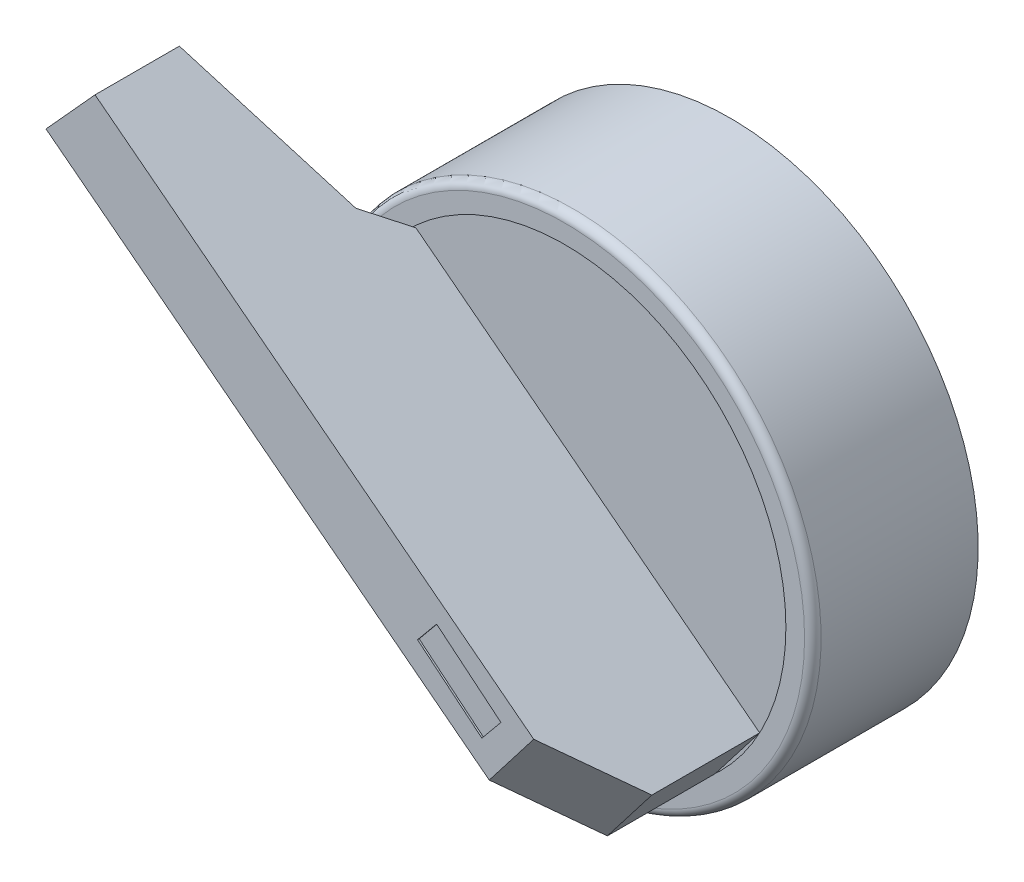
ISO-10303-21;
HEADER;
FILE_DESCRIPTION(('STEP AP214'),'2;1');
FILE_NAME('part.step','',(''),(''),'','','');
FILE_SCHEMA(('AUTOMOTIVE_DESIGN { 1 0 10303 214 1 1 1 1 }'));
ENDSEC;
DATA;
#1=APPLICATION_CONTEXT('core data for automotive mechanical design processes');
#2=APPLICATION_PROTOCOL_DEFINITION('international standard','automotive_design',2000,#1);
#3=PRODUCT_CONTEXT('',#1,'mechanical');
#4=PRODUCT('Part','Part','',(#3));
#5=PRODUCT_RELATED_PRODUCT_CATEGORY('part','',(#4));
#6=PRODUCT_DEFINITION_FORMATION('','',#4);
#7=PRODUCT_DEFINITION_CONTEXT('part definition',#1,'design');
#8=PRODUCT_DEFINITION('design','',#6,#7);
#9=PRODUCT_DEFINITION_SHAPE('','',#8);
#10=(LENGTH_UNIT() NAMED_UNIT(*) SI_UNIT(.MILLI.,.METRE.));
#11=(NAMED_UNIT(*) PLANE_ANGLE_UNIT() SI_UNIT($,.RADIAN.));
#12=(NAMED_UNIT(*) SI_UNIT($,.STERADIAN.) SOLID_ANGLE_UNIT());
#13=UNCERTAINTY_MEASURE_WITH_UNIT(LENGTH_MEASURE(1.E-05),#10,'distance_accuracy_value','');
#14=(GEOMETRIC_REPRESENTATION_CONTEXT(3) GLOBAL_UNCERTAINTY_ASSIGNED_CONTEXT((#13)) GLOBAL_UNIT_ASSIGNED_CONTEXT((#10,
#11,#12)) REPRESENTATION_CONTEXT('',''));
#15=CARTESIAN_POINT('',(0.,0.,0.));
#16=DIRECTION('',(0.,0.,1.));
#17=DIRECTION('',(1.,0.,0.));
#18=AXIS2_PLACEMENT_3D('',#15,#16,#17);
#19=CARTESIAN_POINT('',(0.,0.,19.9));
#20=DIRECTION('',(0.,0.,-1.));
#21=DIRECTION('',(-1.,0.,0.));
#22=AXIS2_PLACEMENT_3D('',#19,#20,#21);
#23=PLANE('',#22);
#24=DIRECTION('',(-0.63622229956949,-0.771505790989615,0.));
#25=VECTOR('',#24,1.);
#26=CARTESIAN_POINT('',(1.08791435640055,-1.78868885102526,19.9));
#27=LINE('',#26,#25);
#28=CARTESIAN_POINT('',(2.24186607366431,-0.389365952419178,19.9));
#29=VERTEX_POINT('',#28);
#30=CARTESIAN_POINT('',(1.08791435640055,-1.78868885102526,19.9));
#31=VERTEX_POINT('',#30);
#32=EDGE_CURVE('P0_E101',#29,#31,#27,.T.);
#33=ORIENTED_EDGE('',*,*,#32,.T.);
#34=DIRECTION('',(0.771505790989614,-0.63622229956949,0.));
#35=VECTOR('',#34,1.);
#36=CARTESIAN_POINT('',(4.97878398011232,-4.99729473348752,19.9));
#37=LINE('',#36,#35);
#38=CARTESIAN_POINT('',(4.97878398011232,-4.99729473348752,19.9));
#39=VERTEX_POINT('',#38);
#40=EDGE_CURVE('P0_E20',#31,#39,#37,.T.);
#41=ORIENTED_EDGE('',*,*,#40,.T.);
#42=DIRECTION('',(0.63622229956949,0.771505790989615,0.));
#43=VECTOR('',#42,1.);
#44=CARTESIAN_POINT('',(6.13273569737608,-3.59797183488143,19.9));
#45=LINE('',#44,#43);
#46=CARTESIAN_POINT('',(6.13273569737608,-3.59797183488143,19.9));
#47=VERTEX_POINT('',#46);
#48=EDGE_CURVE('P0_E97',#39,#47,#45,.T.);
#49=ORIENTED_EDGE('',*,*,#48,.T.);
#50=DIRECTION('',(-0.771505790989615,0.636222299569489,0.));
#51=VECTOR('',#50,1.);
#52=CARTESIAN_POINT('',(2.24186607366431,-0.389365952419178,19.9));
#53=LINE('',#52,#51);
#54=EDGE_CURVE('P0_E119',#47,#29,#53,.T.);
#55=ORIENTED_EDGE('',*,*,#54,.T.);
#56=EDGE_LOOP('',(#33,#41,#49,#55));
#57=FACE_BOUND('',#56,.T.);
#58=ADVANCED_FACE('P0_F17',(#57),#23,.F.);
#59=CARTESIAN_POINT('',(4.97878398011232,-4.99729473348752,19.9));
#60=DIRECTION('',(-0.63622229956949,-0.771505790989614,0.));
#61=DIRECTION('',(0.771505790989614,-0.63622229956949,0.));
#62=AXIS2_PLACEMENT_3D('',#59,#60,#61);
#63=PLANE('',#62);
#64=DIRECTION('',(0.,0.,1.));
#65=VECTOR('',#64,1.);
#66=CARTESIAN_POINT('',(4.97878398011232,-4.99729473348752,19.9));
#67=LINE('',#66,#65);
#68=CARTESIAN_POINT('',(4.97878398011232,-4.99729473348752,20.));
#69=VERTEX_POINT('',#68);
#70=EDGE_CURVE('P0_E106',#69,#39,#67,.F.);
#71=ORIENTED_EDGE('',*,*,#70,.T.);
#72=ORIENTED_EDGE('',*,*,#40,.F.);
#73=DIRECTION('',(0.,0.,1.));
#74=VECTOR('',#73,1.);
#75=CARTESIAN_POINT('',(1.08791435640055,-1.78868885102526,19.9));
#76=LINE('',#75,#74);
#77=CARTESIAN_POINT('',(1.08791435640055,-1.78868885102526,20.));
#78=VERTEX_POINT('',#77);
#79=EDGE_CURVE('P0_E125',#31,#78,#76,.T.);
#80=ORIENTED_EDGE('',*,*,#79,.T.);
#81=DIRECTION('',(0.771505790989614,-0.63622229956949,0.));
#82=VECTOR('',#81,1.);
#83=CARTESIAN_POINT('',(1.08791435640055,-1.78868885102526,20.));
#84=LINE('',#83,#82);
#85=EDGE_CURVE('P0_E116',#78,#69,#84,.T.);
#86=ORIENTED_EDGE('',*,*,#85,.T.);
#87=EDGE_LOOP('',(#71,#72,#80,#86));
#88=FACE_BOUND('',#87,.T.);
#89=ADVANCED_FACE('P0_F115',(#88),#63,.F.);
#90=CARTESIAN_POINT('',(6.13273569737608,-3.59797183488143,19.9));
#91=DIRECTION('',(0.771505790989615,-0.63622229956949,0.));
#92=DIRECTION('',(0.63622229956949,0.771505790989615,0.));
#93=AXIS2_PLACEMENT_3D('',#90,#91,#92);
#94=PLANE('',#93);
#95=DIRECTION('',(0.,0.,1.));
#96=VECTOR('',#95,1.);
#97=CARTESIAN_POINT('',(6.13273569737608,-3.59797183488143,19.9));
#98=LINE('',#97,#96);
#99=CARTESIAN_POINT('',(6.13273569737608,-3.59797183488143,20.));
#100=VERTEX_POINT('',#99);
#101=EDGE_CURVE('P0_E112',#100,#47,#98,.F.);
#102=ORIENTED_EDGE('',*,*,#101,.T.);
#103=ORIENTED_EDGE('',*,*,#48,.F.);
#104=ORIENTED_EDGE('',*,*,#70,.F.);
#105=DIRECTION('',(0.636222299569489,0.771505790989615,0.));
#106=VECTOR('',#105,1.);
#107=CARTESIAN_POINT('',(4.97878398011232,-4.99729473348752,20.));
#108=LINE('',#107,#106);
#109=EDGE_CURVE('P0_E128',#69,#100,#108,.T.);
#110=ORIENTED_EDGE('',*,*,#109,.T.);
#111=EDGE_LOOP('',(#102,#103,#104,#110));
#112=FACE_BOUND('',#111,.T.);
#113=ADVANCED_FACE('P0_F109',(#112),#94,.F.);
#114=CARTESIAN_POINT('',(2.24186607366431,-0.389365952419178,19.9));
#115=DIRECTION('',(0.636222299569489,0.771505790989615,0.));
#116=DIRECTION('',(-0.771505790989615,0.636222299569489,0.));
#117=AXIS2_PLACEMENT_3D('',#114,#115,#116);
#118=PLANE('',#117);
#119=DIRECTION('',(0.,0.,1.));
#120=VECTOR('',#119,1.);
#121=CARTESIAN_POINT('',(2.24186607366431,-0.389365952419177,19.9));
#122=LINE('',#121,#120);
#123=CARTESIAN_POINT('',(2.24186607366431,-0.389365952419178,20.));
#124=VERTEX_POINT('',#123);
#125=EDGE_CURVE('P0_E121',#124,#29,#122,.F.);
#126=ORIENTED_EDGE('',*,*,#125,.T.);
#127=ORIENTED_EDGE('',*,*,#54,.F.);
#128=ORIENTED_EDGE('',*,*,#101,.F.);
#129=DIRECTION('',(-0.771505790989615,0.636222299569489,0.));
#130=VECTOR('',#129,1.);
#131=CARTESIAN_POINT('',(6.13273569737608,-3.59797183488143,20.));
#132=LINE('',#131,#130);
#133=EDGE_CURVE('P0_E130',#100,#124,#132,.T.);
#134=ORIENTED_EDGE('',*,*,#133,.T.);
#135=EDGE_LOOP('',(#126,#127,#128,#134));
#136=FACE_BOUND('',#135,.T.);
#137=ADVANCED_FACE('P0_F240',(#136),#118,.F.);
#138=CARTESIAN_POINT('',(1.08791435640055,-1.78868885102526,19.9));
#139=DIRECTION('',(-0.771505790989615,0.63622229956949,0.));
#140=DIRECTION('',(-0.63622229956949,-0.771505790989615,0.));
#141=AXIS2_PLACEMENT_3D('',#138,#139,#140);
#142=PLANE('',#141);
#143=ORIENTED_EDGE('',*,*,#79,.F.);
#144=ORIENTED_EDGE('',*,*,#32,.F.);
#145=ORIENTED_EDGE('',*,*,#125,.F.);
#146=DIRECTION('',(-0.63622229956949,-0.771505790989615,0.));
#147=VECTOR('',#146,1.);
#148=CARTESIAN_POINT('',(2.24186607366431,-0.389365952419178,20.));
#149=LINE('',#148,#147);
#150=EDGE_CURVE('P0_E133',#124,#78,#149,.T.);
#151=ORIENTED_EDGE('',*,*,#150,.T.);
#152=EDGE_LOOP('',(#143,#144,#145,#151));
#153=FACE_BOUND('',#152,.T.);
#154=ADVANCED_FACE('P0_F236',(#153),#142,.F.);
#155=CARTESIAN_POINT('',(-18.4190395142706,17.0043122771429,20.));
#156=DIRECTION('',(-0.611190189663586,-0.791483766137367,0.));
#157=DIRECTION('',(0.791483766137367,-0.611190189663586,0.));
#158=AXIS2_PLACEMENT_3D('',#155,#156,#157);
#159=PLANE('',#158);
#160=DIRECTION('',(-0.759920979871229,0.586817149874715,0.279581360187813));
#161=VECTOR('',#160,1.);
#162=CARTESIAN_POINT('',(-10.6159452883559,10.9786995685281,12.0279709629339));
#163=LINE('',#162,#161);
#164=CARTESIAN_POINT('',(-10.6159452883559,10.9786995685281,12.0279709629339));
#165=VERTEX_POINT('',#164);
#166=CARTESIAN_POINT('',(-18.4190395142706,17.0043122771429,14.8987953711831));
#167=VERTEX_POINT('',#166);
#168=EDGE_CURVE('P0_E162',#165,#167,#163,.T.);
#169=ORIENTED_EDGE('',*,*,#168,.T.);
#170=DIRECTION('',(0.,0.,1.));
#171=VECTOR('',#170,1.);
#172=CARTESIAN_POINT('',(-18.4190395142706,17.0043122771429,20.));
#173=LINE('',#172,#171);
#174=CARTESIAN_POINT('',(-18.4190395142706,17.0043122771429,20.));
#175=VERTEX_POINT('',#174);
#176=EDGE_CURVE('P0_E168',#167,#175,#173,.T.);
#177=ORIENTED_EDGE('',*,*,#176,.T.);
#178=DIRECTION('',(0.791483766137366,-0.611190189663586,0.));
#179=VECTOR('',#178,1.);
#180=CARTESIAN_POINT('',(-18.4190395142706,17.0043122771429,20.));
#181=LINE('',#180,#179);
#182=CARTESIAN_POINT('',(8.11643301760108,-3.48659503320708,20.));
#183=VERTEX_POINT('',#182);
#184=EDGE_CURVE('P0_E136',#175,#183,#181,.T.);
#185=ORIENTED_EDGE('',*,*,#184,.T.);
#186=DIRECTION('',(0.632721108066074,-0.488592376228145,-0.600784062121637));
#187=VECTOR('',#186,1.);
#188=CARTESIAN_POINT('',(8.11643301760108,-3.48659503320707,20.));
#189=LINE('',#188,#187);
#190=CARTESIAN_POINT('',(11.7823683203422,-6.31746003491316,16.5191053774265));
#191=VERTEX_POINT('',#190);
#192=EDGE_CURVE('P0_E139',#183,#191,#189,.T.);
#193=ORIENTED_EDGE('',*,*,#192,.T.);
#194=DIRECTION('',(0.,0.,1.));
#195=VECTOR('',#194,1.);
#196=CARTESIAN_POINT('',(11.7823683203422,-6.31746003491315,20.));
#197=LINE('',#196,#195);
#198=CARTESIAN_POINT('',(11.7823683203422,-6.31746003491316,10.));
#199=VERTEX_POINT('',#198);
#200=EDGE_CURVE('P0_E147',#191,#199,#197,.F.);
#201=ORIENTED_EDGE('',*,*,#200,.T.);
#202=DIRECTION('',(0.791483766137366,-0.611190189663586,0.));
#203=VECTOR('',#202,1.);
#204=CARTESIAN_POINT('',(-9.01083919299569,9.73922361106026,10.));
#205=LINE('',#204,#203);
#206=CARTESIAN_POINT('',(-9.01083919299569,9.73922361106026,10.));
#207=VERTEX_POINT('',#206);
#208=EDGE_CURVE('P0_E150',#207,#199,#205,.T.);
#209=ORIENTED_EDGE('',*,*,#208,.F.);
#210=DIRECTION('',(-0.559663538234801,0.432176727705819,0.707106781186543));
#211=VECTOR('',#210,1.);
#212=CARTESIAN_POINT('',(-9.01083919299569,9.73922361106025,10.));
#213=LINE('',#212,#211);
#214=EDGE_CURVE('P0_E154',#207,#165,#213,.T.);
#215=ORIENTED_EDGE('',*,*,#214,.T.);
#216=EDGE_LOOP('',(#169,#177,#185,#193,#201,#209,#215));
#217=FACE_BOUND('',#216,.T.);
#218=ADVANCED_FACE('P0_F233',(#217),#159,.F.);
#219=CARTESIAN_POINT('',(0.,0.,20.));
#220=DIRECTION('',(0.,0.,-1.));
#221=DIRECTION('',(-1.,0.,0.));
#222=AXIS2_PLACEMENT_3D('',#219,#220,#221);
#223=PLANE('',#222);
#224=DIRECTION('',(0.611190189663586,0.791483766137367,0.));
#225=VECTOR('',#224,1.);
#226=CARTESIAN_POINT('',(5.42585050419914,-6.97086624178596,20.));
#227=LINE('',#226,#225);
#228=CARTESIAN_POINT('',(5.42585050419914,-6.97086624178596,20.));
#229=VERTEX_POINT('',#228);
#230=EDGE_CURVE('P0_E141',#229,#183,#227,.T.);
#231=ORIENTED_EDGE('',*,*,#230,.T.);
#232=ORIENTED_EDGE('',*,*,#184,.F.);
#233=DIRECTION('',(0.671587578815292,0.74092518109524,0.));
#234=VECTOR('',#233,1.);
#235=CARTESIAN_POINT('',(-21.3847030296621,13.732460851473,20.));
#236=LINE('',#235,#234);
#237=CARTESIAN_POINT('',(-21.3847030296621,13.732460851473,20.));
#238=VERTEX_POINT('',#237);
#239=EDGE_CURVE('P0_E164',#175,#238,#236,.F.);
#240=ORIENTED_EDGE('',*,*,#239,.T.);
#241=DIRECTION('',(-0.791483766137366,0.611190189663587,0.));
#242=VECTOR('',#241,1.);
#243=CARTESIAN_POINT('',(9.09178580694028,-9.80173124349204,20.));
#244=LINE('',#243,#242);
#245=EDGE_CURVE('P0_E171',#238,#229,#244,.F.);
#246=ORIENTED_EDGE('',*,*,#245,.T.);
#247=EDGE_LOOP('',(#231,#232,#240,#246));
#248=FACE_BOUND('',#247,.T.);
#249=ORIENTED_EDGE('',*,*,#133,.F.);
#250=ORIENTED_EDGE('',*,*,#109,.F.);
#251=ORIENTED_EDGE('',*,*,#85,.F.);
#252=ORIENTED_EDGE('',*,*,#150,.F.);
#253=EDGE_LOOP('',(#249,#250,#251,#252));
#254=FACE_BOUND('',#253,.T.);
#255=ADVANCED_FACE('P0_F209',(#248,#254),#223,.F.);
#256=CARTESIAN_POINT('',(20.6002304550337,12.6797688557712,20.));
#257=DIRECTION('',(-0.475510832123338,0.367193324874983,-0.799411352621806));
#258=DIRECTION('',(-0.859448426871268,0.,0.511222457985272));
#259=AXIS2_PLACEMENT_3D('',#256,#257,#258);
#260=PLANE('',#259);
#261=DIRECTION('',(0.632721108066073,-0.488592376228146,-0.600784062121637));
#262=VECTOR('',#261,1.);
#263=CARTESIAN_POINT('',(5.42585050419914,-6.97086624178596,20.));
#264=LINE('',#263,#262);
#265=CARTESIAN_POINT('',(9.09178580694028,-9.80173124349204,16.5191053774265));
#266=VERTEX_POINT('',#265);
#267=EDGE_CURVE('P0_E174',#229,#266,#264,.T.);
#268=ORIENTED_EDGE('',*,*,#267,.T.);
#269=DIRECTION('',(-0.611190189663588,-0.791483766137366,0.));
#270=VECTOR('',#269,1.);
#271=CARTESIAN_POINT('',(11.7823683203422,-6.31746003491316,16.5191053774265));
#272=LINE('',#271,#270);
#273=EDGE_CURVE('P0_E144',#266,#191,#272,.F.);
#274=ORIENTED_EDGE('',*,*,#273,.T.);
#275=ORIENTED_EDGE('',*,*,#192,.F.);
#276=ORIENTED_EDGE('',*,*,#230,.F.);
#277=EDGE_LOOP('',(#268,#274,#275,#276));
#278=FACE_BOUND('',#277,.T.);
#279=ADVANCED_FACE('P0_F207',(#278),#260,.F.);
#280=CARTESIAN_POINT('',(11.7823683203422,-6.31746003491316,20.));
#281=DIRECTION('',(-0.791483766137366,0.611190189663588,0.));
#282=DIRECTION('',(-0.611190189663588,-0.791483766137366,0.));
#283=AXIS2_PLACEMENT_3D('',#280,#281,#282);
#284=PLANE('',#283);
#285=ORIENTED_EDGE('',*,*,#273,.F.);
#286=DIRECTION('',(0.,0.,1.));
#287=VECTOR('',#286,1.);
#288=CARTESIAN_POINT('',(9.09178580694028,-9.80173124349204,20.));
#289=LINE('',#288,#287);
#290=CARTESIAN_POINT('',(9.09178580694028,-9.80173124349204,10.));
#291=VERTEX_POINT('',#290);
#292=EDGE_CURVE('P0_E177',#266,#291,#289,.F.);
#293=ORIENTED_EDGE('',*,*,#292,.T.);
#294=DIRECTION('',(-0.611190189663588,-0.791483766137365,0.));
#295=VECTOR('',#294,1.);
#296=CARTESIAN_POINT('',(11.7823683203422,-6.31746003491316,10.));
#297=LINE('',#296,#295);
#298=EDGE_CURVE('P0_E152',#199,#291,#297,.T.);
#299=ORIENTED_EDGE('',*,*,#298,.F.);
#300=ORIENTED_EDGE('',*,*,#200,.F.);
#301=EDGE_LOOP('',(#285,#293,#299,#300));
#302=FACE_BOUND('',#301,.T.);
#303=ADVANCED_FACE('P0_F204',(#302),#284,.F.);
#304=CARTESIAN_POINT('',(0.,0.,10.));
#305=DIRECTION('',(0.,0.,-1.));
#306=DIRECTION('',(-1.,0.,0.));
#307=AXIS2_PLACEMENT_3D('',#304,#305,#306);
#308=PLANE('',#307);
#309=ORIENTED_EDGE('',*,*,#298,.T.);
#310=DIRECTION('',(-0.791483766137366,0.611190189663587,0.));
#311=VECTOR('',#310,1.);
#312=CARTESIAN_POINT('',(9.09178580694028,-9.80173124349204,10.));
#313=LINE('',#312,#311);
#314=CARTESIAN_POINT('',(-11.7014217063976,6.25495240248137,10.));
#315=VERTEX_POINT('',#314);
#316=EDGE_CURVE('P0_E180',#291,#315,#313,.T.);
#317=ORIENTED_EDGE('',*,*,#316,.T.);
#318=DIRECTION('',(0.611190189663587,0.791483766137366,0.));
#319=VECTOR('',#318,1.);
#320=CARTESIAN_POINT('',(-11.7014217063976,6.25495240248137,10.));
#321=LINE('',#320,#319);
#322=EDGE_CURVE('P0_E156',#315,#207,#321,.T.);
#323=ORIENTED_EDGE('',*,*,#322,.T.);
#324=ORIENTED_EDGE('',*,*,#208,.T.);
#325=EDGE_LOOP('',(#309,#317,#323,#324));
#326=FACE_BOUND('',#325,.T.);
#327=ADVANCED_FACE('P0_F199',(#326),#308,.T.);
#328=CARTESIAN_POINT('',(3.47295824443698,25.9055875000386,10.));
#329=DIRECTION('',(0.559663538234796,-0.432176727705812,0.707106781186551));
#330=DIRECTION('',(0.784115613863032,0.,-0.620614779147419));
#331=AXIS2_PLACEMENT_3D('',#328,#329,#330);
#332=PLANE('',#331);
#333=DIRECTION('',(-0.559663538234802,0.432176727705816,0.707106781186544));
#334=VECTOR('',#333,1.);
#335=CARTESIAN_POINT('',(-11.7014217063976,6.25495240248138,10.));
#336=LINE('',#335,#334);
#337=CARTESIAN_POINT('',(-13.3065278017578,7.49442835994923,12.0279709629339));
#338=VERTEX_POINT('',#337);
#339=EDGE_CURVE('P0_E183',#315,#338,#336,.T.);
#340=ORIENTED_EDGE('',*,*,#339,.T.);
#341=DIRECTION('',(0.611190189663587,0.791483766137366,0.));
#342=VECTOR('',#341,1.);
#343=CARTESIAN_POINT('',(-13.3065278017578,7.49442835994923,12.0279709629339));
#344=LINE('',#343,#342);
#345=EDGE_CURVE('P0_E159',#338,#165,#344,.T.);
#346=ORIENTED_EDGE('',*,*,#345,.T.);
#347=ORIENTED_EDGE('',*,*,#214,.F.);
#348=ORIENTED_EDGE('',*,*,#322,.F.);
#349=EDGE_LOOP('',(#340,#346,#347,#348));
#350=FACE_BOUND('',#349,.T.);
#351=ADVANCED_FACE('P0_F196',(#350),#332,.F.);
#352=CARTESIAN_POINT('',(1.86785214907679,27.1450634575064,12.0279709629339));
#353=DIRECTION('',(0.221284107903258,-0.170877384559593,0.96012200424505));
#354=DIRECTION('',(0.974453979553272,0.,-0.224587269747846));
#355=AXIS2_PLACEMENT_3D('',#352,#353,#354);
#356=PLANE('',#355);
#357=ORIENTED_EDGE('',*,*,#345,.F.);
#358=DIRECTION('',(-0.759920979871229,0.586817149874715,0.279581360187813));
#359=VECTOR('',#358,1.);
#360=CARTESIAN_POINT('',(-13.3065278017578,7.49442835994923,12.0279709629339));
#361=LINE('',#360,#359);
#362=CARTESIAN_POINT('',(-21.3847030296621,13.732460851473,15.));
#363=VERTEX_POINT('',#362);
#364=EDGE_CURVE('P0_E26',#338,#363,#361,.T.);
#365=ORIENTED_EDGE('',*,*,#364,.T.);
#366=DIRECTION('',(0.671411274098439,0.740730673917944,-0.0229122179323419));
#367=VECTOR('',#366,1.);
#368=CARTESIAN_POINT('',(-21.3847030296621,13.732460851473,15.));
#369=LINE('',#368,#367);
#370=EDGE_CURVE('P0_E34',#363,#167,#369,.T.);
#371=ORIENTED_EDGE('',*,*,#370,.T.);
#372=ORIENTED_EDGE('',*,*,#168,.F.);
#373=EDGE_LOOP('',(#357,#365,#371,#372));
#374=FACE_BOUND('',#373,.T.);
#375=ADVANCED_FACE('P0_F189',(#374),#356,.F.);
#376=CARTESIAN_POINT('',(-21.3847030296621,13.732460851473,20.));
#377=DIRECTION('',(0.74092518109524,-0.671587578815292,0.));
#378=DIRECTION('',(0.671587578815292,0.74092518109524,0.));
#379=AXIS2_PLACEMENT_3D('',#376,#377,#378);
#380=PLANE('',#379);
#381=ORIENTED_EDGE('',*,*,#370,.F.);
#382=DIRECTION('',(0.,0.,1.));
#383=VECTOR('',#382,1.);
#384=CARTESIAN_POINT('',(-21.3847030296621,13.732460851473,20.));
#385=LINE('',#384,#383);
#386=EDGE_CURVE('P0_E11',#363,#238,#385,.T.);
#387=ORIENTED_EDGE('',*,*,#386,.T.);
#388=ORIENTED_EDGE('',*,*,#239,.F.);
#389=ORIENTED_EDGE('',*,*,#176,.F.);
#390=EDGE_LOOP('',(#381,#387,#388,#389));
#391=FACE_BOUND('',#390,.T.);
#392=ADVANCED_FACE('P0_F212',(#391),#380,.F.);
#393=CARTESIAN_POINT('',(9.09178580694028,-9.80173124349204,20.));
#394=DIRECTION('',(0.611190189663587,0.791483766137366,0.));
#395=DIRECTION('',(-0.791483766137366,0.611190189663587,0.));
#396=AXIS2_PLACEMENT_3D('',#393,#394,#395);
#397=PLANE('',#396);
#398=ORIENTED_EDGE('',*,*,#364,.F.);
#399=ORIENTED_EDGE('',*,*,#339,.F.);
#400=ORIENTED_EDGE('',*,*,#316,.F.);
#401=ORIENTED_EDGE('',*,*,#292,.F.);
#402=ORIENTED_EDGE('',*,*,#267,.F.);
#403=ORIENTED_EDGE('',*,*,#245,.F.);
#404=ORIENTED_EDGE('',*,*,#386,.F.);
#405=EDGE_LOOP('',(#398,#399,#400,#401,#402,#403,#404));
#406=FACE_BOUND('',#405,.T.);
#407=ADVANCED_FACE('P0_F193',(#406),#397,.F.);
#408=CLOSED_SHELL('',(#58,#89,#113,#137,#154,#218,#255,#279,#303,#327,#351,#375,#392,#407));
#409=MANIFOLD_SOLID_BREP('P0_B1',#408);
#410=CARTESIAN_POINT('',(0.,0.,9.9));
#411=DIRECTION('',(0.,0.,1.));
#412=DIRECTION('',(1.,0.,0.));
#413=AXIS2_PLACEMENT_3D('',#410,#411,#412);
#414=PLANE('',#413);
#415=CARTESIAN_POINT('',(0.,0.,9.9));
#416=DIRECTION('',(0.,0.,1.));
#417=DIRECTION('',(1.,0.,0.));
#418=AXIS2_PLACEMENT_3D('',#415,#416,#417);
#419=CIRCLE('',#418,13.3691624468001);
#420=CARTESIAN_POINT('',(13.3691624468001,0.,9.9));
#421=VERTEX_POINT('',#420);
#422=EDGE_CURVE('P1_E166',#421,#421,#419,.T.);
#423=ORIENTED_EDGE('',*,*,#422,.T.);
#424=EDGE_LOOP('',(#423));
#425=FACE_BOUND('',#424,.T.);
#426=ADVANCED_FACE('P1_F17',(#425),#414,.T.);
#427=CARTESIAN_POINT('',(0.,0.,9.9));
#428=DIRECTION('',(0.,0.,1.));
#429=DIRECTION('',(1.,0.,0.));
#430=AXIS2_PLACEMENT_3D('',#427,#428,#429);
#431=CYLINDRICAL_SURFACE('',#430,13.3691624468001);
#432=CARTESIAN_POINT('',(0.,0.,10.));
#433=DIRECTION('',(0.,0.,1.));
#434=DIRECTION('',(1.,0.,0.));
#435=AXIS2_PLACEMENT_3D('',#432,#433,#434);
#436=CIRCLE('',#435,13.3691624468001);
#437=CARTESIAN_POINT('',(13.3691624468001,0.,10.));
#438=VERTEX_POINT('',#437);
#439=EDGE_CURVE('P1_E41',#438,#438,#436,.F.);
#440=ORIENTED_EDGE('',*,*,#439,.F.);
#441=EDGE_LOOP('',(#440));
#442=FACE_BOUND('',#441,.T.);
#443=ORIENTED_EDGE('',*,*,#422,.F.);
#444=EDGE_LOOP('',(#443));
#445=FACE_BOUND('',#444,.T.);
#446=ADVANCED_FACE('P1_F97',(#442,#445),#431,.F.);
#447=CARTESIAN_POINT('',(0.,0.,10.));
#448=DIRECTION('',(0.,0.,1.));
#449=DIRECTION('',(1.,0.,0.));
#450=AXIS2_PLACEMENT_3D('',#447,#448,#449);
#451=PLANE('',#450);
#452=ORIENTED_EDGE('',*,*,#439,.T.);
#453=EDGE_LOOP('',(#452));
#454=FACE_BOUND('',#453,.T.);
#455=CARTESIAN_POINT('',(0.,0.,10.));
#456=DIRECTION('',(0.,0.,-1.));
#457=DIRECTION('',(-1.,0.,0.));
#458=AXIS2_PLACEMENT_3D('',#455,#456,#457);
#459=CIRCLE('',#458,14.5);
#460=CARTESIAN_POINT('',(-14.5,0.,10.));
#461=VERTEX_POINT('',#460);
#462=CARTESIAN_POINT('',(14.5,0.,10.));
#463=VERTEX_POINT('',#462);
#464=EDGE_CURVE('P1_E34',#461,#463,#459,.T.);
#465=ORIENTED_EDGE('',*,*,#464,.F.);
#466=CARTESIAN_POINT('',(0.,0.,10.));
#467=DIRECTION('',(0.,0.,-1.));
#468=DIRECTION('',(1.,0.,0.));
#469=AXIS2_PLACEMENT_3D('',#466,#467,#468);
#470=CIRCLE('',#469,14.5);
#471=EDGE_CURVE('P1_E39',#463,#461,#470,.T.);
#472=ORIENTED_EDGE('',*,*,#471,.F.);
#473=EDGE_LOOP('',(#465,#472));
#474=FACE_BOUND('',#473,.T.);
#475=ADVANCED_FACE('P1_F38',(#454,#474),#451,.T.);
#476=CARTESIAN_POINT('',(0.,0.,9.5));
#477=DIRECTION('',(0.,0.,1.));
#478=DIRECTION('',(1.,0.,0.));
#479=AXIS2_PLACEMENT_3D('',#476,#477,#478);
#480=TOROIDAL_SURFACE('',#479,14.5,0.5);
#481=CARTESIAN_POINT('',(0.,0.,9.5));
#482=DIRECTION('',(0.,0.,-1.));
#483=DIRECTION('',(-1.,0.,0.));
#484=AXIS2_PLACEMENT_3D('',#481,#482,#483);
#485=CIRCLE('',#484,15.);
#486=CARTESIAN_POINT('',(-15.,0.,9.5));
#487=VERTEX_POINT('',#486);
#488=EDGE_CURVE('P1_E28',#487,#487,#485,.T.);
#489=ORIENTED_EDGE('',*,*,#488,.F.);
#490=EDGE_LOOP('',(#489));
#491=FACE_BOUND('',#490,.T.);
#492=ORIENTED_EDGE('',*,*,#471,.T.);
#493=ORIENTED_EDGE('',*,*,#464,.T.);
#494=EDGE_LOOP('',(#492,#493));
#495=FACE_BOUND('',#494,.T.);
#496=ADVANCED_FACE('P1_F45',(#491,#495),#480,.T.);
#497=CARTESIAN_POINT('',(0.,0.,10.));
#498=DIRECTION('',(0.,0.,-1.));
#499=DIRECTION('',(-1.,0.,0.));
#500=AXIS2_PLACEMENT_3D('',#497,#498,#499);
#501=CYLINDRICAL_SURFACE('',#500,15.);
#502=ORIENTED_EDGE('',*,*,#488,.T.);
#503=EDGE_LOOP('',(#502));
#504=FACE_BOUND('',#503,.T.);
#505=CARTESIAN_POINT('',(0.,0.,0.));
#506=DIRECTION('',(0.,0.,-1.));
#507=DIRECTION('',(-1.,0.,0.));
#508=AXIS2_PLACEMENT_3D('',#505,#506,#507);
#509=CIRCLE('',#508,15.);
#510=CARTESIAN_POINT('',(-15.,0.,0.));
#511=VERTEX_POINT('',#510);
#512=EDGE_CURVE('P1_E11',#511,#511,#509,.F.);
#513=ORIENTED_EDGE('',*,*,#512,.T.);
#514=EDGE_LOOP('',(#513));
#515=FACE_BOUND('',#514,.T.);
#516=ADVANCED_FACE('P1_F62',(#504,#515),#501,.T.);
#517=CARTESIAN_POINT('',(0.,0.,0.));
#518=DIRECTION('',(0.,0.,1.));
#519=DIRECTION('',(1.,0.,0.));
#520=AXIS2_PLACEMENT_3D('',#517,#518,#519);
#521=PLANE('',#520);
#522=ORIENTED_EDGE('',*,*,#512,.F.);
#523=EDGE_LOOP('',(#522));
#524=FACE_BOUND('',#523,.T.);
#525=ADVANCED_FACE('P1_F74',(#524),#521,.F.);
#526=CLOSED_SHELL('',(#426,#446,#475,#496,#516,#525));
#527=MANIFOLD_SOLID_BREP('P1_B1',#526);
#528=ADVANCED_BREP_SHAPE_REPRESENTATION('',(#18,#409,#527),#14);
#529=SHAPE_DEFINITION_REPRESENTATION(#9,#528);
ENDSEC;
END-ISO-10303-21;
